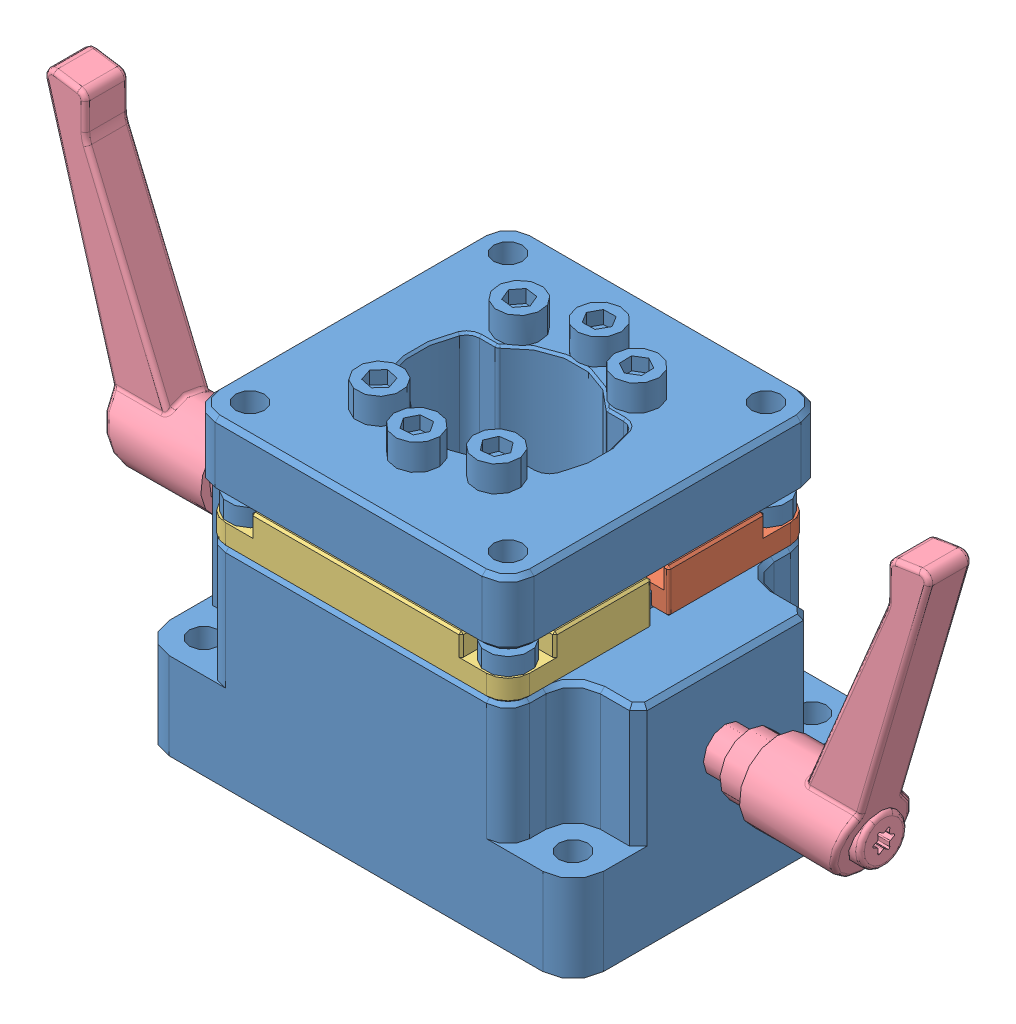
SolidWorks assembly C1A-RC0-XT.sldasm, configuration ﾃﾞﾌｫﾙﾄ (file format 4700). Lengths in mm.
Overall size (203.6 93.3 73.4).
5 component instances, 4 part files, 0 mates.
Components (placement in the parent):
- BODY_ASSY-1: BODY_ASSY.sldprt [ﾃﾞﾌｫﾙﾄ] at (0 48 0) size (100 80.5 73.4)
- Angle piece(A-Part)-1: Angle piece(A-Part).sldprt [ﾃﾞﾌｫﾙﾄ] at (0 48 0) x (0 0 1) z (-1 0 0) size (33 10 70)
- Angle piece(B-Part)-1: Angle piece(B-Part).sldprt [ﾃﾞﾌｫﾙﾄ] at (0 48 0) x (0 0 -1) z (1 0 0) size (33 10 70)
- LEM-10A-25-BK(25)-1: LEM-10A-25-BK(25).sldprt [ﾃﾞﾌｫﾙﾄ] at (-55.5 30.3 0) x (0 1 0) z (1 0 0) size (71.75 17.5 71.3)
- LEM-10A-25-BK(25)-2: LEM-10A-25-BK(25).sldprt [ﾃﾞﾌｫﾙﾄ] at (55.5 30.3 0) x (0 1 0) z (-1 0 0) size (71.75 17.5 71.3)
